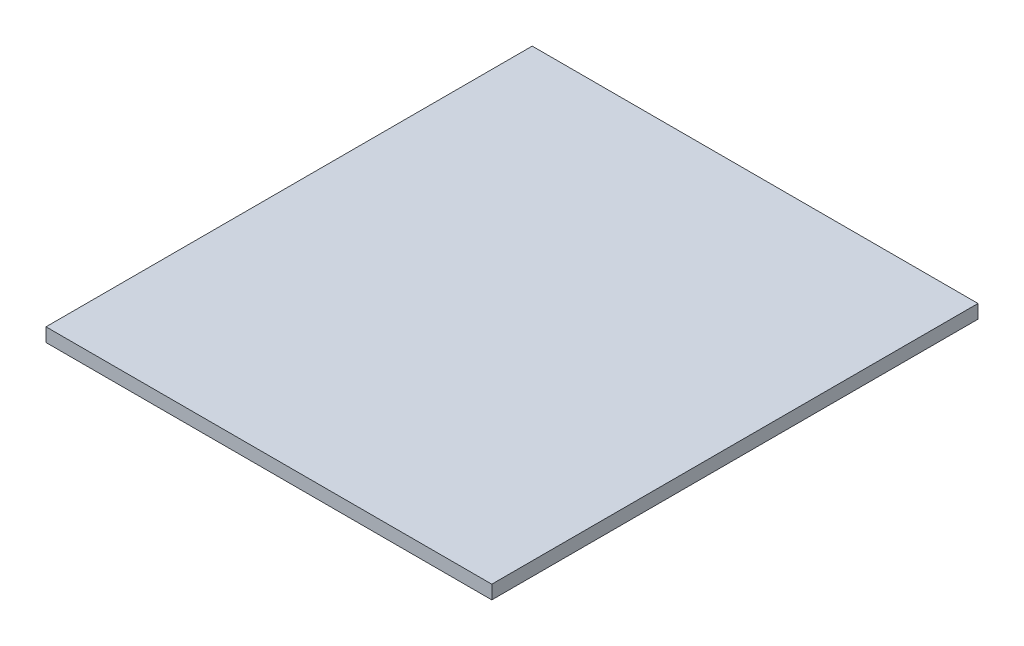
ISO-10303-21;
HEADER;
FILE_DESCRIPTION(('STEP AP214'),'2;1');
FILE_NAME('part.step','',(''),(''),'','','');
FILE_SCHEMA(('AUTOMOTIVE_DESIGN { 1 0 10303 214 1 1 1 1 }'));
ENDSEC;
DATA;
#1=APPLICATION_CONTEXT('core data for automotive mechanical design processes');
#2=APPLICATION_PROTOCOL_DEFINITION('international standard','automotive_design',2000,#1);
#3=PRODUCT_CONTEXT('',#1,'mechanical');
#4=PRODUCT('Part','Part','',(#3));
#5=PRODUCT_RELATED_PRODUCT_CATEGORY('part','',(#4));
#6=PRODUCT_DEFINITION_FORMATION('','',#4);
#7=PRODUCT_DEFINITION_CONTEXT('part definition',#1,'design');
#8=PRODUCT_DEFINITION('design','',#6,#7);
#9=PRODUCT_DEFINITION_SHAPE('','',#8);
#10=(LENGTH_UNIT() NAMED_UNIT(*) SI_UNIT(.MILLI.,.METRE.));
#11=(NAMED_UNIT(*) PLANE_ANGLE_UNIT() SI_UNIT($,.RADIAN.));
#12=(NAMED_UNIT(*) SI_UNIT($,.STERADIAN.) SOLID_ANGLE_UNIT());
#13=UNCERTAINTY_MEASURE_WITH_UNIT(LENGTH_MEASURE(1.E-05),#10,'distance_accuracy_value','');
#14=(GEOMETRIC_REPRESENTATION_CONTEXT(3) GLOBAL_UNCERTAINTY_ASSIGNED_CONTEXT((#13)) GLOBAL_UNIT_ASSIGNED_CONTEXT((#10,
#11,#12)) REPRESENTATION_CONTEXT('',''));
#15=CARTESIAN_POINT('',(0.,0.,0.));
#16=DIRECTION('',(0.,0.,1.));
#17=DIRECTION('',(1.,0.,0.));
#18=AXIS2_PLACEMENT_3D('',#15,#16,#17);
#19=CARTESIAN_POINT('',(-1.63860154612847,0.1,-1.76934103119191));
#20=DIRECTION('',(1.,0.,0.));
#21=DIRECTION('',(0.,0.,-1.));
#22=AXIS2_PLACEMENT_3D('',#19,#20,#21);
#23=PLANE('',#22);
#24=DIRECTION('',(0.,0.,1.));
#25=VECTOR('',#24,1.);
#26=CARTESIAN_POINT('',(-1.63860154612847,0.,-1.76934103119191));
#27=LINE('',#26,#25);
#28=CARTESIAN_POINT('',(-1.63860154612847,0.,-1.76934103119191));
#29=VERTEX_POINT('',#28);
#30=CARTESIAN_POINT('',(-1.63860154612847,0.,1.79548892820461));
#31=VERTEX_POINT('',#30);
#32=EDGE_CURVE('E96',#29,#31,#27,.T.);
#33=ORIENTED_EDGE('',*,*,#32,.T.);
#34=DIRECTION('',(0.,-1.,0.));
#35=VECTOR('',#34,1.);
#36=CARTESIAN_POINT('',(-1.63860154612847,0.1,1.79548892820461));
#37=LINE('',#36,#35);
#38=CARTESIAN_POINT('',(-1.63860154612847,0.1,1.79548892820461));
#39=VERTEX_POINT('',#38);
#40=EDGE_CURVE('E11',#39,#31,#37,.T.);
#41=ORIENTED_EDGE('',*,*,#40,.F.);
#42=DIRECTION('',(0.,0.,1.));
#43=VECTOR('',#42,1.);
#44=CARTESIAN_POINT('',(-1.63860154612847,0.1,-1.76934103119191));
#45=LINE('',#44,#43);
#46=CARTESIAN_POINT('',(-1.63860154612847,0.1,-1.76934103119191));
#47=VERTEX_POINT('',#46);
#48=EDGE_CURVE('E84',#47,#39,#45,.T.);
#49=ORIENTED_EDGE('',*,*,#48,.F.);
#50=DIRECTION('',(0.,-1.,0.));
#51=VECTOR('',#50,1.);
#52=CARTESIAN_POINT('',(-1.63860154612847,0.1,-1.76934103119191));
#53=LINE('',#52,#51);
#54=EDGE_CURVE('E92',#47,#29,#53,.T.);
#55=ORIENTED_EDGE('',*,*,#54,.T.);
#56=EDGE_LOOP('',(#33,#41,#49,#55));
#57=FACE_BOUND('',#56,.T.);
#58=ADVANCED_FACE('F33',(#57),#23,.F.);
#59=CARTESIAN_POINT('',(-1.63860154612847,0.1,1.79548892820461));
#60=DIRECTION('',(0.,0.,-1.));
#61=DIRECTION('',(-1.,0.,0.));
#62=AXIS2_PLACEMENT_3D('',#59,#60,#61);
#63=PLANE('',#62);
#64=DIRECTION('',(1.,0.,0.));
#65=VECTOR('',#64,1.);
#66=CARTESIAN_POINT('',(-1.63860154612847,0.,1.79548892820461));
#67=LINE('',#66,#65);
#68=CARTESIAN_POINT('',(1.62988558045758,0.,1.79548892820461));
#69=VERTEX_POINT('',#68);
#70=EDGE_CURVE('E88',#31,#69,#67,.T.);
#71=ORIENTED_EDGE('',*,*,#70,.T.);
#72=DIRECTION('',(0.,-1.,0.));
#73=VECTOR('',#72,1.);
#74=CARTESIAN_POINT('',(1.62988558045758,0.1,1.79548892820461));
#75=LINE('',#74,#73);
#76=CARTESIAN_POINT('',(1.62988558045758,0.1,1.79548892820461));
#77=VERTEX_POINT('',#76);
#78=EDGE_CURVE('E41',#77,#69,#75,.T.);
#79=ORIENTED_EDGE('',*,*,#78,.F.);
#80=DIRECTION('',(1.,0.,0.));
#81=VECTOR('',#80,1.);
#82=CARTESIAN_POINT('',(-1.63860154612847,0.1,1.79548892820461));
#83=LINE('',#82,#81);
#84=EDGE_CURVE('E79',#39,#77,#83,.T.);
#85=ORIENTED_EDGE('',*,*,#84,.F.);
#86=ORIENTED_EDGE('',*,*,#40,.T.);
#87=EDGE_LOOP('',(#71,#79,#85,#86));
#88=FACE_BOUND('',#87,.T.);
#89=ADVANCED_FACE('F87',(#88),#63,.F.);
#90=CARTESIAN_POINT('',(1.62988558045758,0.1,-1.76934103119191));
#91=DIRECTION('',(-1.,0.,0.));
#92=DIRECTION('',(0.,0.,1.));
#93=AXIS2_PLACEMENT_3D('',#90,#91,#92);
#94=PLANE('',#93);
#95=DIRECTION('',(0.,0.,-1.));
#96=VECTOR('',#95,1.);
#97=CARTESIAN_POINT('',(1.62988558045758,0.,-1.76934103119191));
#98=LINE('',#97,#96);
#99=CARTESIAN_POINT('',(1.62988558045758,0.,-1.76934103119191));
#100=VERTEX_POINT('',#99);
#101=EDGE_CURVE('E66',#69,#100,#98,.T.);
#102=ORIENTED_EDGE('',*,*,#101,.T.);
#103=DIRECTION('',(0.,-1.,0.));
#104=VECTOR('',#103,1.);
#105=CARTESIAN_POINT('',(1.62988558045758,0.1,-1.76934103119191));
#106=LINE('',#105,#104);
#107=CARTESIAN_POINT('',(1.62988558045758,0.1,-1.76934103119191));
#108=VERTEX_POINT('',#107);
#109=EDGE_CURVE('E89',#108,#100,#106,.T.);
#110=ORIENTED_EDGE('',*,*,#109,.F.);
#111=DIRECTION('',(0.,0.,-1.));
#112=VECTOR('',#111,1.);
#113=CARTESIAN_POINT('',(1.62988558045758,0.1,-1.76934103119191));
#114=LINE('',#113,#112);
#115=EDGE_CURVE('E82',#77,#108,#114,.T.);
#116=ORIENTED_EDGE('',*,*,#115,.F.);
#117=ORIENTED_EDGE('',*,*,#78,.T.);
#118=EDGE_LOOP('',(#102,#110,#116,#117));
#119=FACE_BOUND('',#118,.T.);
#120=ADVANCED_FACE('F90',(#119),#94,.F.);
#121=CARTESIAN_POINT('',(-1.63860154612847,0.1,-1.76934103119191));
#122=DIRECTION('',(0.,0.,1.));
#123=DIRECTION('',(1.,0.,0.));
#124=AXIS2_PLACEMENT_3D('',#121,#122,#123);
#125=PLANE('',#124);
#126=DIRECTION('',(-1.,0.,0.));
#127=VECTOR('',#126,1.);
#128=CARTESIAN_POINT('',(-1.63860154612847,0.,-1.76934103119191));
#129=LINE('',#128,#127);
#130=EDGE_CURVE('E72',#100,#29,#129,.T.);
#131=ORIENTED_EDGE('',*,*,#130,.T.);
#132=ORIENTED_EDGE('',*,*,#54,.F.);
#133=DIRECTION('',(-1.,0.,0.));
#134=VECTOR('',#133,1.);
#135=CARTESIAN_POINT('',(-1.63860154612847,0.1,-1.76934103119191));
#136=LINE('',#135,#134);
#137=EDGE_CURVE('E49',#108,#47,#136,.T.);
#138=ORIENTED_EDGE('',*,*,#137,.F.);
#139=ORIENTED_EDGE('',*,*,#109,.T.);
#140=EDGE_LOOP('',(#131,#132,#138,#139));
#141=FACE_BOUND('',#140,.T.);
#142=ADVANCED_FACE('F103',(#141),#125,.F.);
#143=CARTESIAN_POINT('',(0.,0.1,0.));
#144=DIRECTION('',(0.,1.,0.));
#145=DIRECTION('',(0.,0.,1.));
#146=AXIS2_PLACEMENT_3D('',#143,#144,#145);
#147=PLANE('',#146);
#148=ORIENTED_EDGE('',*,*,#48,.T.);
#149=ORIENTED_EDGE('',*,*,#84,.T.);
#150=ORIENTED_EDGE('',*,*,#115,.T.);
#151=ORIENTED_EDGE('',*,*,#137,.T.);
#152=EDGE_LOOP('',(#148,#149,#150,#151));
#153=FACE_BOUND('',#152,.T.);
#154=ADVANCED_FACE('F80',(#153),#147,.T.);
#155=CARTESIAN_POINT('',(0.,0.,0.));
#156=DIRECTION('',(0.,1.,0.));
#157=DIRECTION('',(0.,0.,1.));
#158=AXIS2_PLACEMENT_3D('',#155,#156,#157);
#159=PLANE('',#158);
#160=ORIENTED_EDGE('',*,*,#32,.F.);
#161=ORIENTED_EDGE('',*,*,#130,.F.);
#162=ORIENTED_EDGE('',*,*,#101,.F.);
#163=ORIENTED_EDGE('',*,*,#70,.F.);
#164=EDGE_LOOP('',(#160,#161,#162,#163));
#165=FACE_BOUND('',#164,.T.);
#166=ADVANCED_FACE('F106',(#165),#159,.F.);
#167=CLOSED_SHELL('',(#58,#89,#120,#142,#154,#166));
#168=MANIFOLD_SOLID_BREP('B2',#167);
#169=ADVANCED_BREP_SHAPE_REPRESENTATION('',(#18,#168),#14);
#170=SHAPE_DEFINITION_REPRESENTATION(#9,#169);
ENDSEC;
END-ISO-10303-21;
